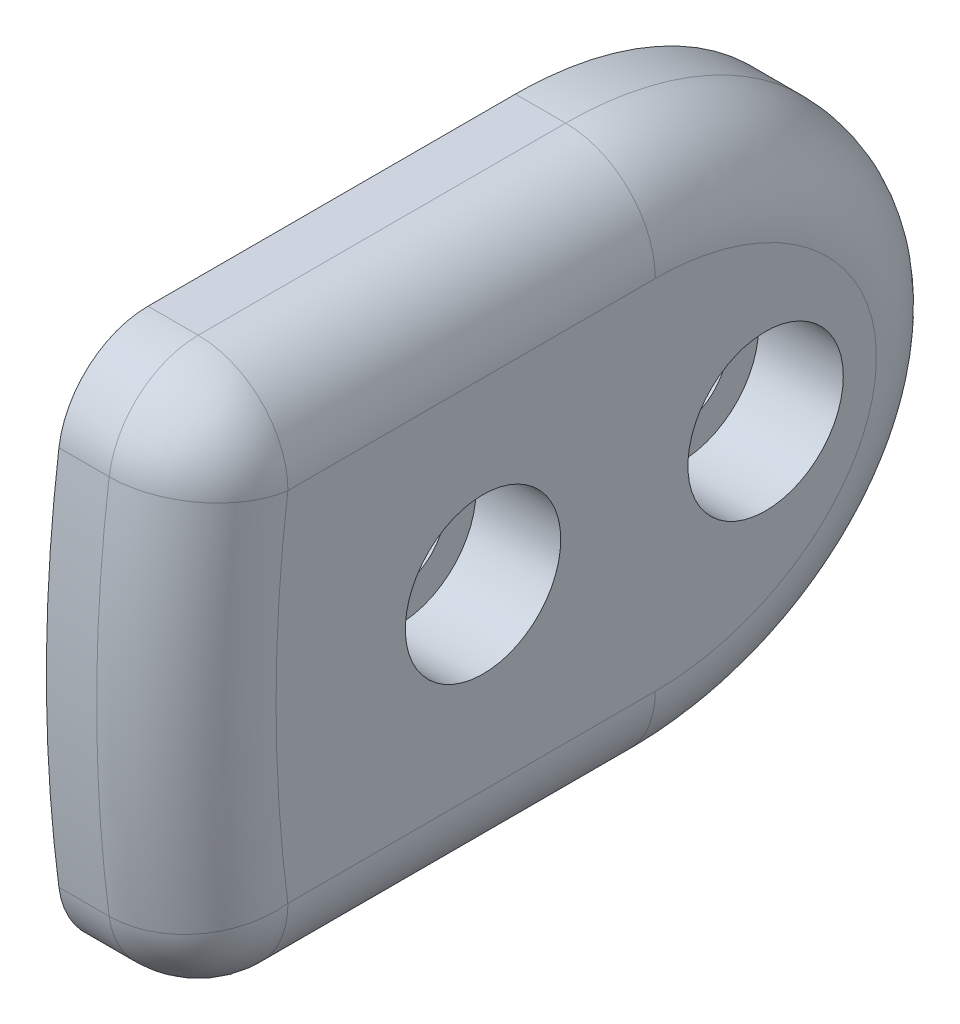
from build123d import *

# Parameters (mm, degrees)
EXTRUDE1_DEPTH                 = 9.906
FILLET1_R                      = 6.35
CBORE_FOR_M6_SHCS1_D           = 6.6
CBORE_FOR_M6_SHCS1_CBORE_D     = 11
CBORE_FOR_M6_SHCS1_CBORE_DEPTH = 6


with BuildPart() as part:
    # Sketch1 → Extrude1 (new body)
    with BuildSketch(Plane(origin=(0, 0, 0), x_dir=(0, 0, -1), z_dir=(1, 0, 0))):
        with BuildLine():
            Line((-95.809811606, 19), (-69.805461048, 19))
            add(Edge.make_bspline(
                [(-47.805461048, 0), (-47.805461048, 19), (-69.805461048, 19)],
                knots=[3.141592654, 3.141592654, 3.141592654, 4.71238898, 4.71238898, 4.71238898], degree=2, weights=[1, 0.707106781, 1]))
            Line((-47.805461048, 0), (-103, 0))
            ThreePointArc((-103, 0), (-102.77855592, 6.750440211), (-102.115175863, 13.471854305))
            ThreePointArc((-102.115175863, 13.471854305), (-100.002603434, 17.42226899), (-95.809811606, 19))
        make_face()
    extrude1 = extrude(amount=EXTRUDE1_DEPTH)

    # Mirror1: Extrude1 across plane
    add(extrude1.mirror(Plane.ZX))

    # Fillet1
    fillet1_edges = [part.edges().sort_by_distance(p)[0] for p in [
        (9.906, 13.914536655, 54.824895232),
        (9.906, -17.42226899, 100.002603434),
        (9.906, -19, 82.807636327),
        (9.906, 19, 82.807636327),
        (9.906, 17.42226899, 100.002603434),
        (9.906, 0, 103),
    ]]
    fillet(fillet1_edges, radius=FILLET1_R)

    # CBORE for M6 SHCS1 (through all)
    with Locations(Plane(origin=(9.906, 0, 0), x_dir=(0, 0, -1), z_dir=(1, 0, 0))):
        with Locations((-82, 0), (-62.000000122, 0)):
            CounterBoreHole(CBORE_FOR_M6_SHCS1_D / 2, CBORE_FOR_M6_SHCS1_CBORE_D / 2, CBORE_FOR_M6_SHCS1_CBORE_DEPTH)


solid = part.part
